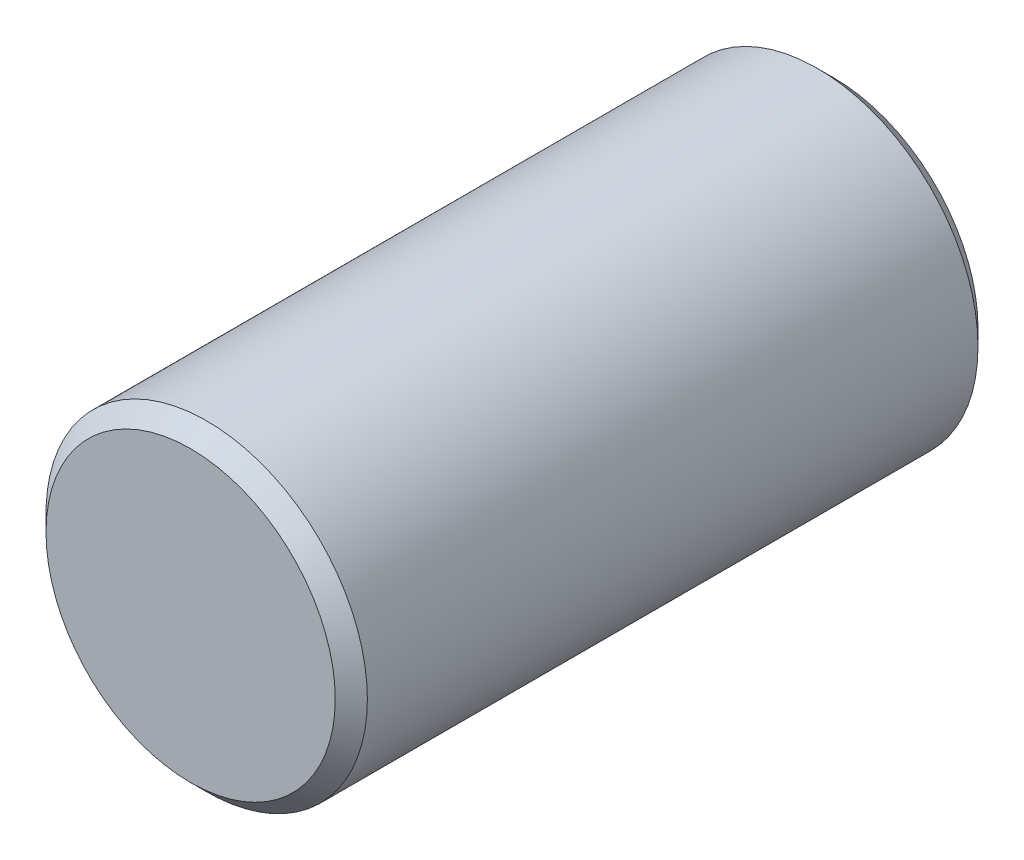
ISO-10303-21;
HEADER;
FILE_DESCRIPTION(('STEP AP214'),'2;1');
FILE_NAME('part.step','',(''),(''),'','','');
FILE_SCHEMA(('AUTOMOTIVE_DESIGN { 1 0 10303 214 1 1 1 1 }'));
ENDSEC;
DATA;
#1=APPLICATION_CONTEXT('core data for automotive mechanical design processes');
#2=APPLICATION_PROTOCOL_DEFINITION('international standard','automotive_design',2000,#1);
#3=PRODUCT_CONTEXT('',#1,'mechanical');
#4=PRODUCT('Part','Part','',(#3));
#5=PRODUCT_RELATED_PRODUCT_CATEGORY('part','',(#4));
#6=PRODUCT_DEFINITION_FORMATION('','',#4);
#7=PRODUCT_DEFINITION_CONTEXT('part definition',#1,'design');
#8=PRODUCT_DEFINITION('design','',#6,#7);
#9=PRODUCT_DEFINITION_SHAPE('','',#8);
#10=(LENGTH_UNIT() NAMED_UNIT(*) SI_UNIT(.MILLI.,.METRE.));
#11=(NAMED_UNIT(*) PLANE_ANGLE_UNIT() SI_UNIT($,.RADIAN.));
#12=(NAMED_UNIT(*) SI_UNIT($,.STERADIAN.) SOLID_ANGLE_UNIT());
#13=UNCERTAINTY_MEASURE_WITH_UNIT(LENGTH_MEASURE(1.E-05),#10,'distance_accuracy_value','');
#14=(GEOMETRIC_REPRESENTATION_CONTEXT(3) GLOBAL_UNCERTAINTY_ASSIGNED_CONTEXT((#13)) GLOBAL_UNIT_ASSIGNED_CONTEXT((#10,
#11,#12)) REPRESENTATION_CONTEXT('',''));
#15=CARTESIAN_POINT('',(0.,0.,0.));
#16=DIRECTION('',(0.,0.,1.));
#17=DIRECTION('',(1.,0.,0.));
#18=AXIS2_PLACEMENT_3D('',#15,#16,#17);
#19=CARTESIAN_POINT('',(0.,0.,20.));
#20=DIRECTION('',(0.,0.,-1.));
#21=DIRECTION('',(-1.,0.,0.));
#22=AXIS2_PLACEMENT_3D('',#19,#20,#21);
#23=CYLINDRICAL_SURFACE('',#22,5.);
#24=CARTESIAN_POINT('',(0.,0.,0.499999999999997));
#25=DIRECTION('',(0.,0.,1.));
#26=DIRECTION('',(1.,0.,0.));
#27=AXIS2_PLACEMENT_3D('',#24,#25,#26);
#28=CIRCLE('',#27,5.);
#29=CARTESIAN_POINT('',(5.,0.,0.499999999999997));
#30=VERTEX_POINT('',#29);
#31=EDGE_CURVE('E46',#30,#30,#28,.T.);
#32=ORIENTED_EDGE('',*,*,#31,.T.);
#33=EDGE_LOOP('',(#32));
#34=FACE_BOUND('',#33,.T.);
#35=CARTESIAN_POINT('',(0.,0.,19.5));
#36=DIRECTION('',(0.,0.,1.));
#37=DIRECTION('',(1.,0.,0.));
#38=AXIS2_PLACEMENT_3D('',#35,#36,#37);
#39=CIRCLE('',#38,5.);
#40=CARTESIAN_POINT('',(5.,0.,19.5));
#41=VERTEX_POINT('',#40);
#42=EDGE_CURVE('E50',#41,#41,#39,.F.);
#43=ORIENTED_EDGE('',*,*,#42,.T.);
#44=EDGE_LOOP('',(#43));
#45=FACE_BOUND('',#44,.T.);
#46=ADVANCED_FACE('F35',(#34,#45),#23,.T.);
#47=CARTESIAN_POINT('',(0.,0.,20.));
#48=DIRECTION('',(0.,0.,1.));
#49=DIRECTION('',(1.,0.,0.));
#50=AXIS2_PLACEMENT_3D('',#47,#48,#49);
#51=PLANE('',#50);
#52=CARTESIAN_POINT('',(0.,0.,20.));
#53=DIRECTION('',(0.,0.,1.));
#54=DIRECTION('',(1.,0.,0.));
#55=AXIS2_PLACEMENT_3D('',#52,#53,#54);
#56=CIRCLE('',#55,4.49999999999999);
#57=CARTESIAN_POINT('',(4.49999999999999,0.,20.));
#58=VERTEX_POINT('',#57);
#59=EDGE_CURVE('E10',#58,#58,#56,.T.);
#60=ORIENTED_EDGE('',*,*,#59,.T.);
#61=EDGE_LOOP('',(#60));
#62=FACE_BOUND('',#61,.T.);
#63=ADVANCED_FACE('F66',(#62),#51,.T.);
#64=CARTESIAN_POINT('',(0.,0.,0.));
#65=DIRECTION('',(0.,0.,1.));
#66=DIRECTION('',(1.,0.,0.));
#67=AXIS2_PLACEMENT_3D('',#64,#65,#66);
#68=PLANE('',#67);
#69=CARTESIAN_POINT('',(0.,0.,0.));
#70=DIRECTION('',(0.,0.,1.));
#71=DIRECTION('',(1.,0.,0.));
#72=AXIS2_PLACEMENT_3D('',#69,#70,#71);
#73=CIRCLE('',#72,4.50000000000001);
#74=CARTESIAN_POINT('',(4.50000000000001,0.,0.));
#75=VERTEX_POINT('',#74);
#76=EDGE_CURVE('E42',#75,#75,#73,.F.);
#77=ORIENTED_EDGE('',*,*,#76,.T.);
#78=EDGE_LOOP('',(#77));
#79=FACE_BOUND('',#78,.T.);
#80=ADVANCED_FACE('F63',(#79),#68,.F.);
#81=CARTESIAN_POINT('',(0.,0.,0.499999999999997));
#82=DIRECTION('',(0.,0.,1.));
#83=DIRECTION('',(1.,0.,0.));
#84=AXIS2_PLACEMENT_3D('',#81,#82,#83);
#85=CONICAL_SURFACE('',#84,5.,0.785398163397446);
#86=ORIENTED_EDGE('',*,*,#76,.F.);
#87=EDGE_LOOP('',(#86));
#88=FACE_BOUND('',#87,.T.);
#89=ORIENTED_EDGE('',*,*,#31,.F.);
#90=EDGE_LOOP('',(#89));
#91=FACE_BOUND('',#90,.T.);
#92=ADVANCED_FACE('F59',(#88,#91),#85,.T.);
#93=CARTESIAN_POINT('',(0.,0.,20.));
#94=DIRECTION('',(0.,0.,-1.));
#95=DIRECTION('',(-1.,0.,0.));
#96=AXIS2_PLACEMENT_3D('',#93,#94,#95);
#97=CONICAL_SURFACE('',#96,4.49999999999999,0.785398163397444);
#98=ORIENTED_EDGE('',*,*,#42,.F.);
#99=EDGE_LOOP('',(#98));
#100=FACE_BOUND('',#99,.T.);
#101=ORIENTED_EDGE('',*,*,#59,.F.);
#102=EDGE_LOOP('',(#101));
#103=FACE_BOUND('',#102,.T.);
#104=ADVANCED_FACE('F37',(#100,#103),#97,.T.);
#105=CLOSED_SHELL('',(#46,#63,#80,#92,#104));
#106=MANIFOLD_SOLID_BREP('B2',#105);
#107=ADVANCED_BREP_SHAPE_REPRESENTATION('',(#18,#106),#14);
#108=SHAPE_DEFINITION_REPRESENTATION(#9,#107);
ENDSEC;
END-ISO-10303-21;
